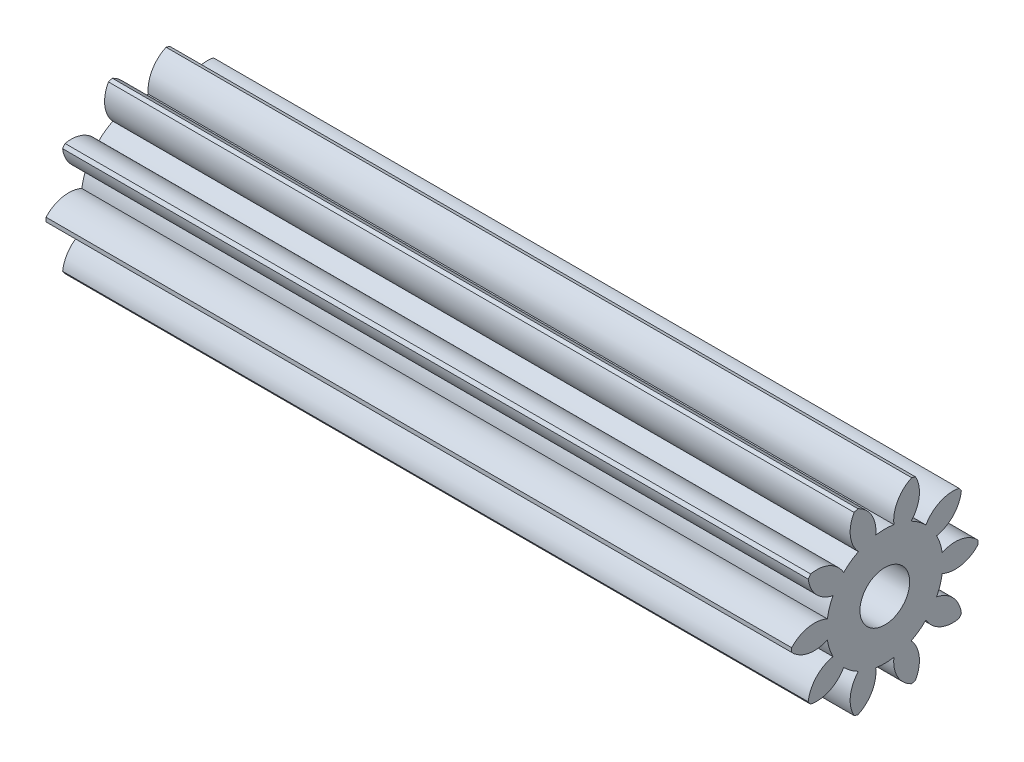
from build123d import *

# Parameters (mm, degrees)
BASPROSKE_W     = 12
BASPROSKE_H     = 1.5
TOOTHCUT_DEPTH  = 13.186057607
TEETHCUTS_COUNT = 10
BORSKE_R        = 0.4
BORE_DEPTH      = 50.0000508


with BuildPart() as part:
    # BasProSke → Base-Revolve (revolve)
    with BuildSketch(Plane(origin=(0, 0, 0), x_dir=(1, 0, 0), z_dir=(0, 1, 0)), mode=Mode.PRIVATE) as base_revolve_sk:
        with Locations((6, 0.75)):
            Rectangle(BASPROSKE_W, BASPROSKE_H)
    revolve(base_revolve_sk.sketch.rotate(Axis((-10, 0, 0), (1, 0, 0)), 180), axis=Axis((-10, 0, 0), (1, 0, 0)))

    # TooCutSke → ToothCut (cut, through all)
    with BuildSketch(Plane(origin=(0, 0, 0), x_dir=(0, 0, -1), z_dir=(1, 0, 0))):
        with BuildLine():
            ThreePointArc((0.146321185, 0.924998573), (0, 0.9365), (-0.146321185, 0.924998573))
            ThreePointArc((-0.146321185, 0.924998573), (-0.216454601, 1.244005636), (-0.468585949, 1.451644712))
            ThreePointArc((-0.468585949, 1.451644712), (0, 1.5254), (0.468585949, 1.451644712))
            ThreePointArc((0.468585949, 1.451644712), (0.216454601, 1.244005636), (0.146321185, 0.924998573))
        make_face()
    toothcut = extrude(amount=TOOTHCUT_DEPTH, mode=Mode.SUBTRACT)

    # TeethCuts: ToothCut ×10 about axis
    teethcuts_axis = Axis((0, 0, 0), (1, 0, 0))
    for i in range(1, TEETHCUTS_COUNT):
        add(toothcut.rotate(teethcuts_axis, i * 360 / TEETHCUTS_COUNT), mode=Mode.SUBTRACT)

    # BorSke → Bore (cut, symmetric)
    with BuildSketch(Plane(origin=(0, 0, 0), x_dir=(0, 0, -1), z_dir=(1, 0, 0))):
        with Locations(Location((0, 0, 0), (0, 0, 180))):
            Circle(BORSKE_R)
    extrude(amount=BORE_DEPTH, both=True, mode=Mode.SUBTRACT)


solid = part.part
